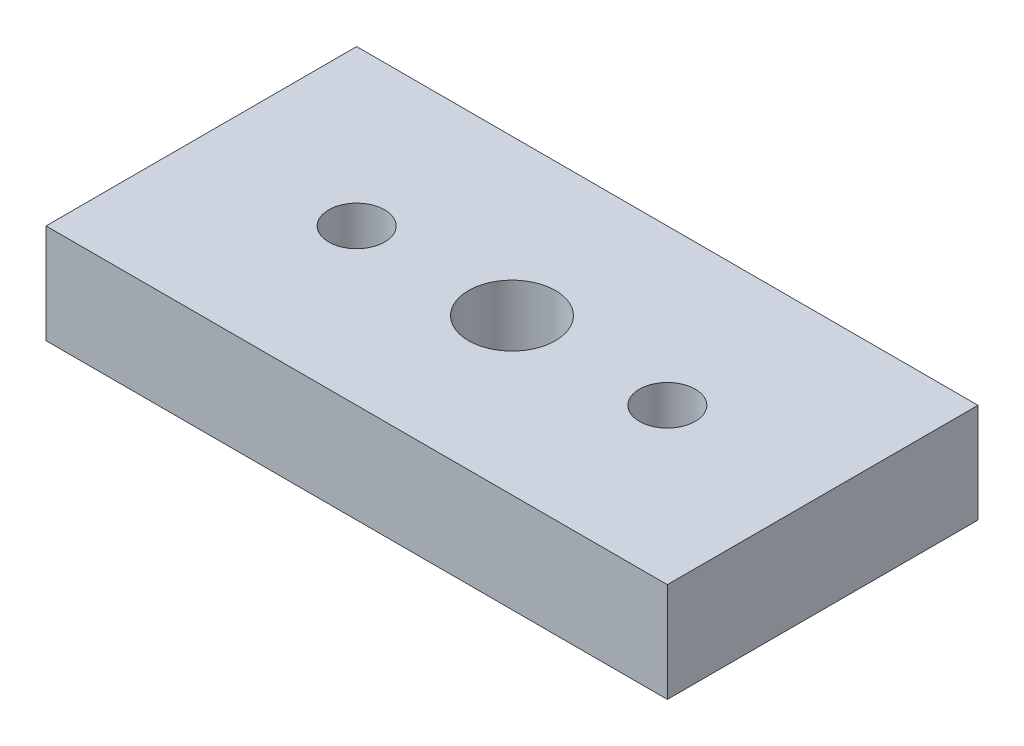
ISO-10303-21;
HEADER;
FILE_DESCRIPTION(('STEP AP214'),'2;1');
FILE_NAME('part.step','',(''),(''),'','','');
FILE_SCHEMA(('AUTOMOTIVE_DESIGN { 1 0 10303 214 1 1 1 1 }'));
ENDSEC;
DATA;
#1=APPLICATION_CONTEXT('core data for automotive mechanical design processes');
#2=APPLICATION_PROTOCOL_DEFINITION('international standard','automotive_design',2000,#1);
#3=PRODUCT_CONTEXT('',#1,'mechanical');
#4=PRODUCT('Part','Part','',(#3));
#5=PRODUCT_RELATED_PRODUCT_CATEGORY('part','',(#4));
#6=PRODUCT_DEFINITION_FORMATION('','',#4);
#7=PRODUCT_DEFINITION_CONTEXT('part definition',#1,'design');
#8=PRODUCT_DEFINITION('design','',#6,#7);
#9=PRODUCT_DEFINITION_SHAPE('','',#8);
#10=(LENGTH_UNIT() NAMED_UNIT(*) SI_UNIT(.MILLI.,.METRE.));
#11=(NAMED_UNIT(*) PLANE_ANGLE_UNIT() SI_UNIT($,.RADIAN.));
#12=(NAMED_UNIT(*) SI_UNIT($,.STERADIAN.) SOLID_ANGLE_UNIT());
#13=UNCERTAINTY_MEASURE_WITH_UNIT(LENGTH_MEASURE(1.E-05),#10,'distance_accuracy_value','');
#14=(GEOMETRIC_REPRESENTATION_CONTEXT(3) GLOBAL_UNCERTAINTY_ASSIGNED_CONTEXT((#13)) GLOBAL_UNIT_ASSIGNED_CONTEXT((#10,
#11,#12)) REPRESENTATION_CONTEXT('',''));
#15=CARTESIAN_POINT('',(0.,0.,0.));
#16=DIRECTION('',(0.,0.,1.));
#17=DIRECTION('',(1.,0.,0.));
#18=AXIS2_PLACEMENT_3D('',#15,#16,#17);
#19=CARTESIAN_POINT('',(-50.,16.,25.));
#20=DIRECTION('',(0.,0.,-1.));
#21=DIRECTION('',(-1.,0.,0.));
#22=AXIS2_PLACEMENT_3D('',#19,#20,#21);
#23=PLANE('',#22);
#24=DIRECTION('',(1.,0.,0.));
#25=VECTOR('',#24,1.);
#26=CARTESIAN_POINT('',(-50.,0.,25.));
#27=LINE('',#26,#25);
#28=CARTESIAN_POINT('',(-50.,0.,25.));
#29=VERTEX_POINT('',#28);
#30=CARTESIAN_POINT('',(50.,0.,25.));
#31=VERTEX_POINT('',#30);
#32=EDGE_CURVE('E102',#29,#31,#27,.T.);
#33=ORIENTED_EDGE('',*,*,#32,.T.);
#34=DIRECTION('',(0.,-1.,0.));
#35=VECTOR('',#34,1.);
#36=CARTESIAN_POINT('',(50.,16.,25.));
#37=LINE('',#36,#35);
#38=CARTESIAN_POINT('',(50.,16.,25.));
#39=VERTEX_POINT('',#38);
#40=EDGE_CURVE('E11',#39,#31,#37,.T.);
#41=ORIENTED_EDGE('',*,*,#40,.F.);
#42=DIRECTION('',(1.,0.,0.));
#43=VECTOR('',#42,1.);
#44=CARTESIAN_POINT('',(-50.,16.,25.));
#45=LINE('',#44,#43);
#46=CARTESIAN_POINT('',(-50.,16.,25.));
#47=VERTEX_POINT('',#46);
#48=EDGE_CURVE('E90',#47,#39,#45,.T.);
#49=ORIENTED_EDGE('',*,*,#48,.F.);
#50=DIRECTION('',(0.,-1.,0.));
#51=VECTOR('',#50,1.);
#52=CARTESIAN_POINT('',(-50.,16.,25.));
#53=LINE('',#52,#51);
#54=EDGE_CURVE('E98',#47,#29,#53,.T.);
#55=ORIENTED_EDGE('',*,*,#54,.T.);
#56=EDGE_LOOP('',(#33,#41,#49,#55));
#57=FACE_BOUND('',#56,.T.);
#58=ADVANCED_FACE('F39',(#57),#23,.F.);
#59=CARTESIAN_POINT('',(50.,16.,-25.));
#60=DIRECTION('',(-1.,0.,0.));
#61=DIRECTION('',(0.,0.,1.));
#62=AXIS2_PLACEMENT_3D('',#59,#60,#61);
#63=PLANE('',#62);
#64=DIRECTION('',(0.,0.,-1.));
#65=VECTOR('',#64,1.);
#66=CARTESIAN_POINT('',(50.,0.,-25.));
#67=LINE('',#66,#65);
#68=CARTESIAN_POINT('',(50.,0.,-25.));
#69=VERTEX_POINT('',#68);
#70=EDGE_CURVE('E94',#31,#69,#67,.T.);
#71=ORIENTED_EDGE('',*,*,#70,.T.);
#72=DIRECTION('',(0.,-1.,0.));
#73=VECTOR('',#72,1.);
#74=CARTESIAN_POINT('',(50.,16.,-25.));
#75=LINE('',#74,#73);
#76=CARTESIAN_POINT('',(50.,16.,-25.));
#77=VERTEX_POINT('',#76);
#78=EDGE_CURVE('E47',#77,#69,#75,.T.);
#79=ORIENTED_EDGE('',*,*,#78,.F.);
#80=DIRECTION('',(0.,0.,-1.));
#81=VECTOR('',#80,1.);
#82=CARTESIAN_POINT('',(50.,16.,-25.));
#83=LINE('',#82,#81);
#84=EDGE_CURVE('E85',#39,#77,#83,.T.);
#85=ORIENTED_EDGE('',*,*,#84,.F.);
#86=ORIENTED_EDGE('',*,*,#40,.T.);
#87=EDGE_LOOP('',(#71,#79,#85,#86));
#88=FACE_BOUND('',#87,.T.);
#89=ADVANCED_FACE('F93',(#88),#63,.F.);
#90=CARTESIAN_POINT('',(-50.,16.,-25.));
#91=DIRECTION('',(0.,0.,1.));
#92=DIRECTION('',(1.,0.,0.));
#93=AXIS2_PLACEMENT_3D('',#90,#91,#92);
#94=PLANE('',#93);
#95=DIRECTION('',(-1.,0.,0.));
#96=VECTOR('',#95,1.);
#97=CARTESIAN_POINT('',(-50.,0.,-25.));
#98=LINE('',#97,#96);
#99=CARTESIAN_POINT('',(-50.,0.,-25.));
#100=VERTEX_POINT('',#99);
#101=EDGE_CURVE('E72',#69,#100,#98,.T.);
#102=ORIENTED_EDGE('',*,*,#101,.T.);
#103=DIRECTION('',(0.,-1.,0.));
#104=VECTOR('',#103,1.);
#105=CARTESIAN_POINT('',(-50.,16.,-25.));
#106=LINE('',#105,#104);
#107=CARTESIAN_POINT('',(-50.,16.,-25.));
#108=VERTEX_POINT('',#107);
#109=EDGE_CURVE('E95',#108,#100,#106,.T.);
#110=ORIENTED_EDGE('',*,*,#109,.F.);
#111=DIRECTION('',(-1.,0.,0.));
#112=VECTOR('',#111,1.);
#113=CARTESIAN_POINT('',(-50.,16.,-25.));
#114=LINE('',#113,#112);
#115=EDGE_CURVE('E88',#77,#108,#114,.T.);
#116=ORIENTED_EDGE('',*,*,#115,.F.);
#117=ORIENTED_EDGE('',*,*,#78,.T.);
#118=EDGE_LOOP('',(#102,#110,#116,#117));
#119=FACE_BOUND('',#118,.T.);
#120=ADVANCED_FACE('F96',(#119),#94,.F.);
#121=CARTESIAN_POINT('',(-50.,16.,-25.));
#122=DIRECTION('',(1.,0.,0.));
#123=DIRECTION('',(0.,0.,-1.));
#124=AXIS2_PLACEMENT_3D('',#121,#122,#123);
#125=PLANE('',#124);
#126=DIRECTION('',(0.,0.,1.));
#127=VECTOR('',#126,1.);
#128=CARTESIAN_POINT('',(-50.,0.,-25.));
#129=LINE('',#128,#127);
#130=EDGE_CURVE('E78',#100,#29,#129,.T.);
#131=ORIENTED_EDGE('',*,*,#130,.T.);
#132=ORIENTED_EDGE('',*,*,#54,.F.);
#133=DIRECTION('',(0.,0.,1.));
#134=VECTOR('',#133,1.);
#135=CARTESIAN_POINT('',(-50.,16.,-25.));
#136=LINE('',#135,#134);
#137=EDGE_CURVE('E55',#108,#47,#136,.T.);
#138=ORIENTED_EDGE('',*,*,#137,.F.);
#139=ORIENTED_EDGE('',*,*,#109,.T.);
#140=EDGE_LOOP('',(#131,#132,#138,#139));
#141=FACE_BOUND('',#140,.T.);
#142=ADVANCED_FACE('F110',(#141),#125,.F.);
#143=CARTESIAN_POINT('',(50.,16.,25.));
#144=DIRECTION('',(0.,-1.,0.));
#145=DIRECTION('',(0.,0.,-1.));
#146=AXIS2_PLACEMENT_3D('',#143,#144,#145);
#147=PLANE('',#146);
#148=CARTESIAN_POINT('',(-25.,16.,0.));
#149=DIRECTION('',(0.,-1.,0.));
#150=DIRECTION('',(0.,0.,-1.));
#151=AXIS2_PLACEMENT_3D('',#148,#149,#150);
#152=CIRCLE('',#151,4.5);
#153=CARTESIAN_POINT('',(-25.,16.,-4.5));
#154=VERTEX_POINT('',#153);
#155=EDGE_CURVE('E133',#154,#154,#152,.T.);
#156=ORIENTED_EDGE('',*,*,#155,.T.);
#157=EDGE_LOOP('',(#156));
#158=FACE_BOUND('',#157,.T.);
#159=CARTESIAN_POINT('',(25.,16.,0.));
#160=DIRECTION('',(0.,-1.,0.));
#161=DIRECTION('',(0.,0.,-1.));
#162=AXIS2_PLACEMENT_3D('',#159,#160,#161);
#163=CIRCLE('',#162,4.5);
#164=CARTESIAN_POINT('',(25.,16.,-4.5));
#165=VERTEX_POINT('',#164);
#166=EDGE_CURVE('E121',#165,#165,#163,.T.);
#167=ORIENTED_EDGE('',*,*,#166,.T.);
#168=EDGE_LOOP('',(#167));
#169=FACE_BOUND('',#168,.T.);
#170=CARTESIAN_POINT('',(0.,16.,0.));
#171=DIRECTION('',(0.,1.,0.));
#172=DIRECTION('',(0.,0.,1.));
#173=AXIS2_PLACEMENT_3D('',#170,#171,#172);
#174=CIRCLE('',#173,7.);
#175=CARTESIAN_POINT('',(0.,16.,7.));
#176=VERTEX_POINT('',#175);
#177=EDGE_CURVE('E118',#176,#176,#174,.T.);
#178=ORIENTED_EDGE('',*,*,#177,.F.);
#179=EDGE_LOOP('',(#178));
#180=FACE_BOUND('',#179,.T.);
#181=ORIENTED_EDGE('',*,*,#48,.T.);
#182=ORIENTED_EDGE('',*,*,#84,.T.);
#183=ORIENTED_EDGE('',*,*,#115,.T.);
#184=ORIENTED_EDGE('',*,*,#137,.T.);
#185=EDGE_LOOP('',(#181,#182,#183,#184));
#186=FACE_BOUND('',#185,.T.);
#187=ADVANCED_FACE('F86',(#158,#169,#180,#186),#147,.F.);
#188=CARTESIAN_POINT('',(50.,0.,25.));
#189=DIRECTION('',(0.,-1.,0.));
#190=DIRECTION('',(0.,0.,-1.));
#191=AXIS2_PLACEMENT_3D('',#188,#189,#190);
#192=PLANE('',#191);
#193=CARTESIAN_POINT('',(-25.,0.,0.));
#194=DIRECTION('',(0.,-1.,0.));
#195=DIRECTION('',(0.,0.,-1.));
#196=AXIS2_PLACEMENT_3D('',#193,#194,#195);
#197=CIRCLE('',#196,7.);
#198=CARTESIAN_POINT('',(-25.,0.,-7.));
#199=VERTEX_POINT('',#198);
#200=EDGE_CURVE('E142',#199,#199,#197,.T.);
#201=ORIENTED_EDGE('',*,*,#200,.F.);
#202=EDGE_LOOP('',(#201));
#203=FACE_BOUND('',#202,.T.);
#204=CARTESIAN_POINT('',(25.,0.,0.));
#205=DIRECTION('',(0.,-1.,0.));
#206=DIRECTION('',(0.,0.,-1.));
#207=AXIS2_PLACEMENT_3D('',#204,#205,#206);
#208=CIRCLE('',#207,6.99999999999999);
#209=CARTESIAN_POINT('',(25.,0.,-7.));
#210=VERTEX_POINT('',#209);
#211=EDGE_CURVE('E130',#210,#210,#208,.T.);
#212=ORIENTED_EDGE('',*,*,#211,.F.);
#213=EDGE_LOOP('',(#212));
#214=FACE_BOUND('',#213,.T.);
#215=CARTESIAN_POINT('',(0.,0.,0.));
#216=DIRECTION('',(0.,1.,0.));
#217=DIRECTION('',(0.,0.,1.));
#218=AXIS2_PLACEMENT_3D('',#215,#216,#217);
#219=CIRCLE('',#218,7.);
#220=CARTESIAN_POINT('',(0.,0.,7.));
#221=VERTEX_POINT('',#220);
#222=EDGE_CURVE('E105',#221,#221,#219,.T.);
#223=ORIENTED_EDGE('',*,*,#222,.T.);
#224=EDGE_LOOP('',(#223));
#225=FACE_BOUND('',#224,.T.);
#226=ORIENTED_EDGE('',*,*,#32,.F.);
#227=ORIENTED_EDGE('',*,*,#130,.F.);
#228=ORIENTED_EDGE('',*,*,#101,.F.);
#229=ORIENTED_EDGE('',*,*,#70,.F.);
#230=EDGE_LOOP('',(#226,#227,#228,#229));
#231=FACE_BOUND('',#230,.T.);
#232=ADVANCED_FACE('F113',(#203,#214,#225,#231),#192,.T.);
#233=CARTESIAN_POINT('',(0.,16.,0.));
#234=DIRECTION('',(0.,1.,0.));
#235=DIRECTION('',(0.,0.,1.));
#236=AXIS2_PLACEMENT_3D('',#233,#234,#235);
#237=CYLINDRICAL_SURFACE('',#236,7.);
#238=ORIENTED_EDGE('',*,*,#222,.F.);
#239=EDGE_LOOP('',(#238));
#240=FACE_BOUND('',#239,.T.);
#241=ORIENTED_EDGE('',*,*,#177,.T.);
#242=EDGE_LOOP('',(#241));
#243=FACE_BOUND('',#242,.T.);
#244=ADVANCED_FACE('F150',(#240,#243),#237,.F.);
#245=CARTESIAN_POINT('',(25.,0.,0.));
#246=DIRECTION('',(0.,-1.,0.));
#247=DIRECTION('',(0.,0.,-1.));
#248=AXIS2_PLACEMENT_3D('',#245,#246,#247);
#249=CYLINDRICAL_SURFACE('',#248,4.5);
#250=ORIENTED_EDGE('',*,*,#166,.F.);
#251=EDGE_LOOP('',(#250));
#252=FACE_BOUND('',#251,.T.);
#253=CARTESIAN_POINT('',(25.,8.6,0.));
#254=DIRECTION('',(0.,-1.,0.));
#255=DIRECTION('',(0.,0.,-1.));
#256=AXIS2_PLACEMENT_3D('',#253,#254,#255);
#257=CIRCLE('',#256,4.50000000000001);
#258=CARTESIAN_POINT('',(25.,8.6,-4.50000000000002));
#259=VERTEX_POINT('',#258);
#260=EDGE_CURVE('E124',#259,#259,#257,.T.);
#261=ORIENTED_EDGE('',*,*,#260,.T.);
#262=EDGE_LOOP('',(#261));
#263=FACE_BOUND('',#262,.T.);
#264=ADVANCED_FACE('F158',(#252,#263),#249,.F.);
#265=CARTESIAN_POINT('',(29.5,8.6,0.));
#266=DIRECTION('',(0.,1.,0.));
#267=DIRECTION('',(0.,0.,1.));
#268=AXIS2_PLACEMENT_3D('',#265,#266,#267);
#269=PLANE('',#268);
#270=ORIENTED_EDGE('',*,*,#260,.F.);
#271=EDGE_LOOP('',(#270));
#272=FACE_BOUND('',#271,.T.);
#273=CARTESIAN_POINT('',(25.,8.6,0.));
#274=DIRECTION('',(0.,-1.,0.));
#275=DIRECTION('',(0.,0.,-1.));
#276=AXIS2_PLACEMENT_3D('',#273,#274,#275);
#277=CIRCLE('',#276,7.);
#278=CARTESIAN_POINT('',(25.,8.6,-7.00000000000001));
#279=VERTEX_POINT('',#278);
#280=EDGE_CURVE('E127',#279,#279,#277,.T.);
#281=ORIENTED_EDGE('',*,*,#280,.T.);
#282=EDGE_LOOP('',(#281));
#283=FACE_BOUND('',#282,.T.);
#284=ADVANCED_FACE('F211',(#272,#283),#269,.F.);
#285=CARTESIAN_POINT('',(25.,0.,0.));
#286=DIRECTION('',(0.,-1.,0.));
#287=DIRECTION('',(0.,0.,-1.));
#288=AXIS2_PLACEMENT_3D('',#285,#286,#287);
#289=CYLINDRICAL_SURFACE('',#288,7.);
#290=ORIENTED_EDGE('',*,*,#280,.F.);
#291=EDGE_LOOP('',(#290));
#292=FACE_BOUND('',#291,.T.);
#293=ORIENTED_EDGE('',*,*,#211,.T.);
#294=EDGE_LOOP('',(#293));
#295=FACE_BOUND('',#294,.T.);
#296=ADVANCED_FACE('F221',(#292,#295),#289,.F.);
#297=CARTESIAN_POINT('',(-25.,0.,0.));
#298=DIRECTION('',(0.,-1.,0.));
#299=DIRECTION('',(0.,0.,-1.));
#300=AXIS2_PLACEMENT_3D('',#297,#298,#299);
#301=CYLINDRICAL_SURFACE('',#300,4.5);
#302=ORIENTED_EDGE('',*,*,#155,.F.);
#303=EDGE_LOOP('',(#302));
#304=FACE_BOUND('',#303,.T.);
#305=CARTESIAN_POINT('',(-25.,8.6,0.));
#306=DIRECTION('',(0.,-1.,0.));
#307=DIRECTION('',(0.,0.,-1.));
#308=AXIS2_PLACEMENT_3D('',#305,#306,#307);
#309=CIRCLE('',#308,4.50000000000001);
#310=CARTESIAN_POINT('',(-25.,8.6,-4.50000000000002));
#311=VERTEX_POINT('',#310);
#312=EDGE_CURVE('E136',#311,#311,#309,.T.);
#313=ORIENTED_EDGE('',*,*,#312,.T.);
#314=EDGE_LOOP('',(#313));
#315=FACE_BOUND('',#314,.T.);
#316=ADVANCED_FACE('F231',(#304,#315),#301,.F.);
#317=CARTESIAN_POINT('',(-20.5,8.6,0.));
#318=DIRECTION('',(0.,1.,0.));
#319=DIRECTION('',(0.,0.,1.));
#320=AXIS2_PLACEMENT_3D('',#317,#318,#319);
#321=PLANE('',#320);
#322=ORIENTED_EDGE('',*,*,#312,.F.);
#323=EDGE_LOOP('',(#322));
#324=FACE_BOUND('',#323,.T.);
#325=CARTESIAN_POINT('',(-25.,8.6,0.));
#326=DIRECTION('',(0.,-1.,0.));
#327=DIRECTION('',(0.,0.,-1.));
#328=AXIS2_PLACEMENT_3D('',#325,#326,#327);
#329=CIRCLE('',#328,7.);
#330=CARTESIAN_POINT('',(-25.,8.6,-7.00000000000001));
#331=VERTEX_POINT('',#330);
#332=EDGE_CURVE('E139',#331,#331,#329,.T.);
#333=ORIENTED_EDGE('',*,*,#332,.T.);
#334=EDGE_LOOP('',(#333));
#335=FACE_BOUND('',#334,.T.);
#336=ADVANCED_FACE('F241',(#324,#335),#321,.F.);
#337=CARTESIAN_POINT('',(-25.,0.,0.));
#338=DIRECTION('',(0.,-1.,0.));
#339=DIRECTION('',(0.,0.,-1.));
#340=AXIS2_PLACEMENT_3D('',#337,#338,#339);
#341=CYLINDRICAL_SURFACE('',#340,7.);
#342=ORIENTED_EDGE('',*,*,#332,.F.);
#343=EDGE_LOOP('',(#342));
#344=FACE_BOUND('',#343,.T.);
#345=ORIENTED_EDGE('',*,*,#200,.T.);
#346=EDGE_LOOP('',(#345));
#347=FACE_BOUND('',#346,.T.);
#348=ADVANCED_FACE('F146',(#344,#347),#341,.F.);
#349=CLOSED_SHELL('',(#58,#89,#120,#142,#187,#232,#244,#264,#284,#296,#316,#336,#348));
#350=MANIFOLD_SOLID_BREP('B2',#349);
#351=ADVANCED_BREP_SHAPE_REPRESENTATION('',(#18,#350),#14);
#352=SHAPE_DEFINITION_REPRESENTATION(#9,#351);
ENDSEC;
END-ISO-10303-21;
